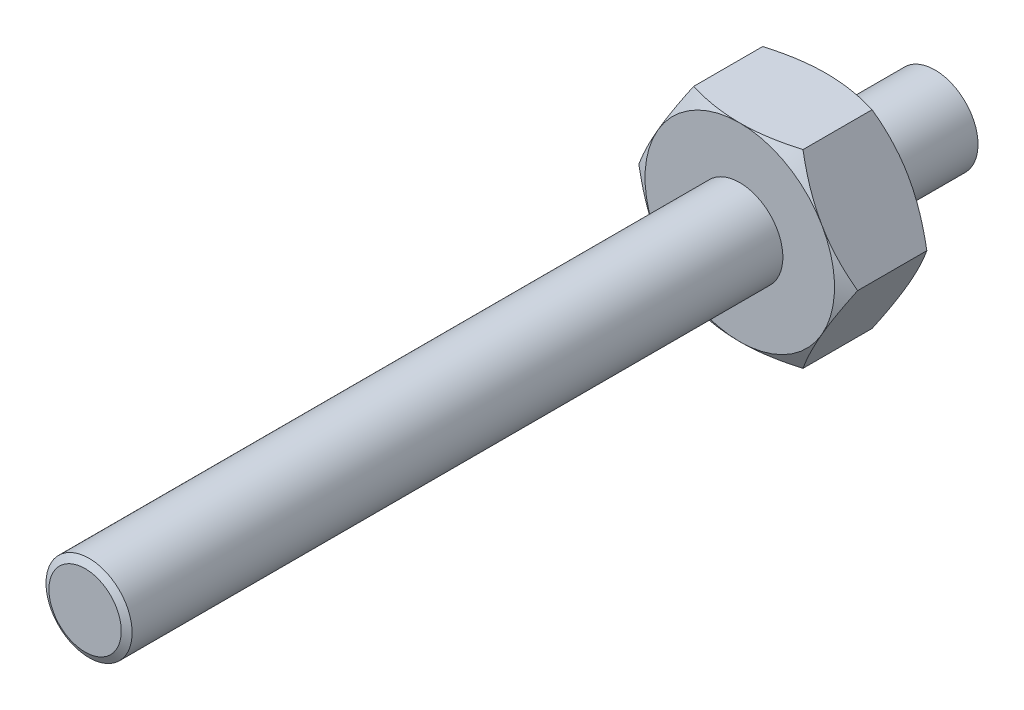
ISO-10303-21;
HEADER;
FILE_DESCRIPTION(('STEP AP214'),'2;1');
FILE_NAME('part.step','',(''),(''),'','','');
FILE_SCHEMA(('AUTOMOTIVE_DESIGN { 1 0 10303 214 1 1 1 1 }'));
ENDSEC;
DATA;
#1=APPLICATION_CONTEXT('core data for automotive mechanical design processes');
#2=APPLICATION_PROTOCOL_DEFINITION('international standard','automotive_design',2000,#1);
#3=PRODUCT_CONTEXT('',#1,'mechanical');
#4=PRODUCT('Part','Part','',(#3));
#5=PRODUCT_RELATED_PRODUCT_CATEGORY('part','',(#4));
#6=PRODUCT_DEFINITION_FORMATION('','',#4);
#7=PRODUCT_DEFINITION_CONTEXT('part definition',#1,'design');
#8=PRODUCT_DEFINITION('design','',#6,#7);
#9=PRODUCT_DEFINITION_SHAPE('','',#8);
#10=(LENGTH_UNIT() NAMED_UNIT(*) SI_UNIT(.MILLI.,.METRE.));
#11=(NAMED_UNIT(*) PLANE_ANGLE_UNIT() SI_UNIT($,.RADIAN.));
#12=(NAMED_UNIT(*) SI_UNIT($,.STERADIAN.) SOLID_ANGLE_UNIT());
#13=UNCERTAINTY_MEASURE_WITH_UNIT(LENGTH_MEASURE(1.E-05),#10,'distance_accuracy_value','');
#14=(GEOMETRIC_REPRESENTATION_CONTEXT(3) GLOBAL_UNCERTAINTY_ASSIGNED_CONTEXT((#13)) GLOBAL_UNIT_ASSIGNED_CONTEXT((#10,
#11,#12)) REPRESENTATION_CONTEXT('',''));
#15=CARTESIAN_POINT('',(0.,0.,0.));
#16=DIRECTION('',(0.,0.,1.));
#17=DIRECTION('',(1.,0.,0.));
#18=AXIS2_PLACEMENT_3D('',#15,#16,#17);
#19=CARTESIAN_POINT('',(0.,0.,0.));
#20=DIRECTION('',(0.,0.,-1.));
#21=DIRECTION('',(-1.,0.,0.));
#22=AXIS2_PLACEMENT_3D('',#19,#20,#21);
#23=CYLINDRICAL_SURFACE('',#22,5.);
#24=CARTESIAN_POINT('',(0.,0.,1.33962096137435));
#25=DIRECTION('',(0.,0.,1.));
#26=DIRECTION('',(1.,0.,0.));
#27=AXIS2_PLACEMENT_3D('',#24,#25,#26);
#28=CIRCLE('',#27,5.);
#29=CARTESIAN_POINT('',(0.,4.99999999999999,1.33962096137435));
#30=VERTEX_POINT('',#29);
#31=EDGE_CURVE('E251',#30,#30,#28,.T.);
#32=ORIENTED_EDGE('',*,*,#31,.T.);
#33=EDGE_LOOP('',(#32));
#34=FACE_BOUND('',#33,.T.);
#35=CARTESIAN_POINT('',(0.,0.,14.));
#36=DIRECTION('',(0.,0.,-1.));
#37=DIRECTION('',(-1.,0.,0.));
#38=AXIS2_PLACEMENT_3D('',#35,#36,#37);
#39=CIRCLE('',#38,5.);
#40=CARTESIAN_POINT('',(-5.,0.,14.));
#41=VERTEX_POINT('',#40);
#42=EDGE_CURVE('E252',#41,#41,#39,.T.);
#43=ORIENTED_EDGE('',*,*,#42,.T.);
#44=EDGE_LOOP('',(#43));
#45=FACE_BOUND('',#44,.T.);
#46=ADVANCED_FACE('F31',(#34,#45),#23,.T.);
#47=CARTESIAN_POINT('',(0.,13.5,14.));
#48=DIRECTION('',(0.,0.,1.));
#49=DIRECTION('',(1.,0.,0.));
#50=AXIS2_PLACEMENT_3D('',#47,#48,#49);
#51=PLANE('',#50);
#52=ORIENTED_EDGE('',*,*,#42,.F.);
#53=EDGE_LOOP('',(#52));
#54=FACE_BOUND('',#53,.T.);
#55=CARTESIAN_POINT('',(0.,0.,14.));
#56=DIRECTION('',(0.,0.,-1.));
#57=DIRECTION('',(-1.,0.,0.));
#58=AXIS2_PLACEMENT_3D('',#55,#56,#57);
#59=CIRCLE('',#58,11.);
#60=CARTESIAN_POINT('',(9.52627944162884,5.49999999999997,14.));
#61=VERTEX_POINT('',#60);
#62=CARTESIAN_POINT('',(9.52627944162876,-5.50000000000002,14.));
#63=VERTEX_POINT('',#62);
#64=EDGE_CURVE('E506',#61,#63,#59,.T.);
#65=ORIENTED_EDGE('',*,*,#64,.T.);
#66=CARTESIAN_POINT('',(0.,-11.,14.));
#67=VERTEX_POINT('',#66);
#68=EDGE_CURVE('E504',#63,#67,#59,.T.);
#69=ORIENTED_EDGE('',*,*,#68,.T.);
#70=CARTESIAN_POINT('',(-9.52627944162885,-5.49999999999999,14.));
#71=VERTEX_POINT('',#70);
#72=EDGE_CURVE('E500',#67,#71,#59,.T.);
#73=ORIENTED_EDGE('',*,*,#72,.T.);
#74=CARTESIAN_POINT('',(-9.52627944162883,5.5,14.));
#75=VERTEX_POINT('',#74);
#76=EDGE_CURVE('E51',#71,#75,#59,.T.);
#77=ORIENTED_EDGE('',*,*,#76,.T.);
#78=CARTESIAN_POINT('',(0.,11.,14.));
#79=VERTEX_POINT('',#78);
#80=EDGE_CURVE('E157',#75,#79,#59,.T.);
#81=ORIENTED_EDGE('',*,*,#80,.T.);
#82=EDGE_CURVE('E507',#79,#61,#59,.T.);
#83=ORIENTED_EDGE('',*,*,#82,.T.);
#84=EDGE_LOOP('',(#65,#69,#73,#77,#81,#83));
#85=FACE_BOUND('',#84,.T.);
#86=ADVANCED_FACE('F297',(#54,#85),#51,.F.);
#87=CARTESIAN_POINT('',(0.,0.,9.99987499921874));
#88=DIRECTION('',(0.,0.,-1.));
#89=DIRECTION('',(0.,1.,0.));
#90=AXIS2_PLACEMENT_3D('',#87,#88,#89);
#91=SPHERICAL_SURFACE('',#90,10.);
#92=CARTESIAN_POINT('',(0.,0.,0.));
#93=DIRECTION('',(0.,0.,-1.));
#94=DIRECTION('',(-1.,0.,0.));
#95=AXIS2_PLACEMENT_3D('',#92,#93,#94);
#96=CIRCLE('',#95,0.05);
#97=CARTESIAN_POINT('',(0.,0.050000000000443,0.));
#98=VERTEX_POINT('',#97);
#99=EDGE_CURVE('E248',#98,#98,#96,.T.);
#100=CARTESIAN_POINT('',(0.,0.050000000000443,0.));
#101=CARTESIAN_POINT('',(0.,0.104020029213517,0.000270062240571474));
#102=CARTESIAN_POINT('',(0.,0.158037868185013,0.000977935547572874));
#103=CARTESIAN_POINT('',(0.,0.266054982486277,0.00326893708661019));
#104=CARTESIAN_POINT('',(0.,0.320054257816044,0.00485206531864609));
#105=CARTESIAN_POINT('',(0.,0.428020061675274,0.00889320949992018));
#106=CARTESIAN_POINT('',(0.,0.481986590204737,0.0113512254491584));
#107=CARTESIAN_POINT('',(0.,0.589872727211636,0.0171414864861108));
#108=CARTESIAN_POINT('',(0.,0.643792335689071,0.0204737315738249));
#109=CARTESIAN_POINT('',(0.,0.751570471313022,0.0280115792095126));
#110=CARTESIAN_POINT('',(0.,0.805428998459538,0.032217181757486));
#111=CARTESIAN_POINT('',(0.,0.913070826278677,0.0415006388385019));
#112=CARTESIAN_POINT('',(0.,0.9668541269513,0.0465784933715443));
#113=CARTESIAN_POINT('',(0.,1.07433137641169,0.0576051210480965));
#114=CARTESIAN_POINT('',(0.,1.12802532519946,0.0635538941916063));
#115=CARTESIAN_POINT('',(0.,1.23530976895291,0.0763207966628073));
#116=CARTESIAN_POINT('',(0.,1.28890026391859,0.0831389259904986));
#117=CARTESIAN_POINT('',(0.,1.39596372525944,0.0976427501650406));
#118=CARTESIAN_POINT('',(0.,1.44943669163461,0.105328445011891));
#119=CARTESIAN_POINT('',(0.,1.55625105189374,0.121565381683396));
#120=CARTESIAN_POINT('',(0.,1.60959244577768,0.13011662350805));
#121=CARTESIAN_POINT('',(0.,1.71612965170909,0.148082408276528));
#122=CARTESIAN_POINT('',(0.,1.76932546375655,0.157496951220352));
#123=CARTESIAN_POINT('',(0.,1.87555753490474,0.177186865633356));
#124=CARTESIAN_POINT('',(0.,1.92859379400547,0.187462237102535));
#125=CARTESIAN_POINT('',(0.,2.03449283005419,0.208871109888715));
#126=CARTESIAN_POINT('',(0.,2.08735560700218,0.220004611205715));
#127=CARTESIAN_POINT('',(0.,2.19289379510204,0.243126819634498));
#128=CARTESIAN_POINT('',(0.,2.24556920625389,0.25511552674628));
#129=CARTESIAN_POINT('',(0.,2.35071882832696,0.279944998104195));
#130=CARTESIAN_POINT('',(0.,2.40319303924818,0.292785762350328));
#131=CARTESIAN_POINT('',(0.,2.50792647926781,0.319315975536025));
#132=CARTESIAN_POINT('',(0.,2.56018570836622,0.333005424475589));
#133=CARTESIAN_POINT('',(0.,2.66447545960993,0.361229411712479));
#134=CARTESIAN_POINT('',(0.,2.71650598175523,0.375763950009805));
#135=CARTESIAN_POINT('',(0.,2.820324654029,0.405674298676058));
#136=CARTESIAN_POINT('',(0.,2.87211280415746,0.421050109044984));
#137=CARTESIAN_POINT('',(0.,2.97543313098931,0.452638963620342));
#138=CARTESIAN_POINT('',(0.,3.0269653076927,0.468852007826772));
#139=CARTESIAN_POINT('',(0.,3.1297601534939,0.502111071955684));
#140=CARTESIAN_POINT('',(0.,3.18102282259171,0.519157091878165));
#141=CARTESIAN_POINT('',(0.,3.2832651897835,0.554077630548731));
#142=CARTESIAN_POINT('',(0.,3.33424488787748,0.571952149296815));
#143=CARTESIAN_POINT('',(0.,3.43590792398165,0.608524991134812));
#144=CARTESIAN_POINT('',(0.,3.48659126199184,0.627223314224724));
#145=CARTESIAN_POINT('',(0.,3.58764826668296,0.665438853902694));
#146=CARTESIAN_POINT('',(0.,3.63802193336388,0.684956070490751));
#147=CARTESIAN_POINT('',(0.,3.73844636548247,0.724804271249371));
#148=CARTESIAN_POINT('',(0.,3.78849713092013,0.745135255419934));
#149=CARTESIAN_POINT('',(0.,3.88826261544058,0.786605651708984));
#150=CARTESIAN_POINT('',(0.,3.93797733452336,0.807745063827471));
#151=CARTESIAN_POINT('',(0.,4.03705766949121,0.850826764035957));
#152=CARTESIAN_POINT('',(0.,4.08642328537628,0.872769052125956));
#153=CARTESIAN_POINT('',(0.,4.18479244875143,0.917450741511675));
#154=CARTESIAN_POINT('',(0.,4.23379599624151,0.940190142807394));
#155=CARTESIAN_POINT('',(0.,4.33142815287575,0.986460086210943));
#156=CARTESIAN_POINT('',(0.,4.38005676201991,1.00999062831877));
#157=CARTESIAN_POINT('',(0.,4.47692626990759,1.05783667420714));
#158=CARTESIAN_POINT('',(0.,4.52516716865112,1.08215217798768));
#159=CARTESIAN_POINT('',(0.,4.62124858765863,1.13156175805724));
#160=CARTESIAN_POINT('',(0.,4.66908910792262,1.15665583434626));
#161=CARTESIAN_POINT('',(0.,4.76435719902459,1.20761598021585));
#162=CARTESIAN_POINT('',(0.,4.81178476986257,1.23348204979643));
#163=CARTESIAN_POINT('',(0.,4.90621452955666,1.28597934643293));
#164=CARTESIAN_POINT('',(0.,4.95321671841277,1.31261057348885));
#165=CARTESIAN_POINT('',(0.,4.99999999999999,1.33962096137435));
#166=B_SPLINE_CURVE_WITH_KNOTS('',3,(#100,#101,#102,#103,#104,#105,#106,#107,#108,#109,#110,
#111,#112,#113,#114,#115,#116,#117,#118,#119,#120,#121,#122,#123,#124,#125,#126,#127,#128,#129,
#130,#131,#132,#133,#134,#135,#136,#137,#138,#139,#140,#141,#142,#143,#144,#145,#146,#147,#148,
#149,#150,#151,#152,#153,#154,#155,#156,#157,#158,#159,#160,#161,#162,#163,#164,#165),
.UNSPECIFIED.,.F.,.F.,(4,2,2,2,2,2,2,2,2,2,2,2,2,2,2,2,2,2,2,2,2,2,2,2,2,2,2,2,2,2,2,2,4),(0.,
0.16206033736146,0.324120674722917,0.486181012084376,0.648241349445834,0.810301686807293,
0.972362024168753,1.13442236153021,1.29648269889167,1.45854303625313,1.62060337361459,
1.78266371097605,1.94472404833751,2.10678438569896,2.26884472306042,2.43090506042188,
2.59296539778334,2.7550257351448,2.91708607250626,3.07914640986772,3.24120674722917,
3.40326708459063,3.56532742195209,3.72738775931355,3.88944809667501,4.05150843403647,
4.21356877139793,4.37562910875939,4.53768944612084,4.6997497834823,4.86181012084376,
5.02387045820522,5.18593079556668),.UNSPECIFIED.);
#167=EDGE_CURVE('BSEAM187',#98,#30,#166,.T.);
#168=ORIENTED_EDGE('',*,*,#99,.F.);
#169=ORIENTED_EDGE('',*,*,#31,.F.);
#170=ORIENTED_EDGE('',*,*,#167,.T.);
#171=ORIENTED_EDGE('',*,*,#167,.F.);
#172=EDGE_LOOP('',(#168,#170,#169,#171));
#173=FACE_BOUND('',#172,.T.);
#174=ADVANCED_FACE('F187',(#173),#91,.T.);
#175=CARTESIAN_POINT('',(-1.12757025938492E-13,-21.9999999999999,0.));
#176=DIRECTION('',(0.,0.,-1.));
#177=DIRECTION('',(-1.,0.,0.));
#178=AXIS2_PLACEMENT_3D('',#175,#176,#177);
#179=PLANE('',#178);
#180=ORIENTED_EDGE('',*,*,#99,.T.);
#181=EDGE_LOOP('',(#180));
#182=FACE_BOUND('',#181,.T.);
#183=ADVANCED_FACE('F343',(#182),#179,.T.);
#184=CARTESIAN_POINT('',(0.,0.,15.0675202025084));
#185=DIRECTION('',(0.,0.,1.));
#186=DIRECTION('',(1.,0.,0.));
#187=AXIS2_PLACEMENT_3D('',#184,#185,#186);
#188=CONICAL_SURFACE('',#187,12.8489992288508,1.0471975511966);
#189=CARTESIAN_POINT('',(-6.35073749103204,11.0002,14.9825470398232));
#190=CARTESIAN_POINT('',(-6.49034297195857,10.7583962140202,14.9019591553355));
#191=CARTESIAN_POINT('',(-6.63046897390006,10.515690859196,14.8250289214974));
#192=CARTESIAN_POINT('',(-6.91184468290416,10.0283338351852,14.6794986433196));
#193=CARTESIAN_POINT('',(-7.05309474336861,9.78368155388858,14.6109013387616));
#194=CARTESIAN_POINT('',(-7.47912088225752,9.0457826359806,14.4189363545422));
#195=CARTESIAN_POINT('',(-7.7655787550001,8.54962304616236,14.3097477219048));
#196=CARTESIAN_POINT('',(-8.19424982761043,7.80714296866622,14.1817141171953));
#197=CARTESIAN_POINT('',(-8.33518236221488,7.56304065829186,14.1452422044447));
#198=CARTESIAN_POINT('',(-8.61769996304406,7.07370581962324,14.084081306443));
#199=CARTESIAN_POINT('',(-8.7592850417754,6.82847326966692,14.0593925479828));
#200=CARTESIAN_POINT('',(-9.0426912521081,6.33759931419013,14.0224303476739));
#201=CARTESIAN_POINT('',(-9.18451190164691,6.0919587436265,14.0101421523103));
#202=CARTESIAN_POINT('',(-9.468284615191,5.60044998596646,13.9982429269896));
#203=CARTESIAN_POINT('',(-9.61023667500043,5.35458180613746,13.9986315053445));
#204=CARTESIAN_POINT('',(-9.8756168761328,4.89492981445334,14.0112011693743));
#205=CARTESIAN_POINT('',(-9.99906394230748,4.68111322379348,14.0218490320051));
#206=CARTESIAN_POINT('',(-10.2456741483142,4.25397181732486,14.0525316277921));
#207=CARTESIAN_POINT('',(-10.3688372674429,4.04064703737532,14.0725670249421));
#208=CARTESIAN_POINT('',(-10.6148126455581,3.61460518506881,14.1216753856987));
#209=CARTESIAN_POINT('',(-10.7376245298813,3.40188876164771,14.150755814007));
#210=CARTESIAN_POINT('',(-10.9826725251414,2.97745318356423,14.2174439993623));
#211=CARTESIAN_POINT('',(-11.1049085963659,2.76573409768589,14.2550523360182));
#212=CARTESIAN_POINT('',(-11.4759630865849,2.12304886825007,14.3816199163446));
#213=CARTESIAN_POINT('',(-11.7237069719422,1.69394387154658,14.4831994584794));
#214=CARTESIAN_POINT('',(-12.2155005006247,0.842132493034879,14.7137436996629));
#215=CARTESIAN_POINT('',(-12.4595564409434,0.419415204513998,14.8426542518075));
#216=CARTESIAN_POINT('',(-12.7018213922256,-0.000200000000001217,14.9825470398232));
#217=B_SPLINE_CURVE_WITH_KNOTS('',3,(#189,#190,#191,#192,#193,#194,#195,#196,#197,#198,#199,
#200,#201,#202,#203,#204,#205,#206,#207,#208,#209,#210,#211,#212,#213,#214,#215,#216),
.UNSPECIFIED.,.F.,.F.,(4,2,2,2,2,2,2,2,2,2,2,2,2,4),(0.,0.871755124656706,1.74379610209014,
3.49159027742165,4.34403665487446,5.19649943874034,6.04794680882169,6.89936787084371,
7.64056020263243,8.38180496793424,9.12366309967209,9.86557166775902,11.3820155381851,
12.8954827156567),.UNSPECIFIED.);
#218=CARTESIAN_POINT('',(-12.7017059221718,0.,14.9824803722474));
#219=VERTEX_POINT('',#218);
#220=EDGE_CURVE('E35',#75,#219,#217,.T.);
#221=ORIENTED_EDGE('',*,*,#220,.F.);
#222=ORIENTED_EDGE('',*,*,#76,.F.);
#223=CARTESIAN_POINT('',(-12.7018213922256,0.000199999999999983,14.9825470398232));
#224=CARTESIAN_POINT('',(-12.5622159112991,-0.241603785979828,14.9019591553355));
#225=CARTESIAN_POINT('',(-12.4220899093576,-0.484309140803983,14.8250289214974));
#226=CARTESIAN_POINT('',(-12.1407142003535,-0.971666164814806,14.6794986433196));
#227=CARTESIAN_POINT('',(-11.999464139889,-1.21631844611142,14.6109013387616));
#228=CARTESIAN_POINT('',(-11.5734380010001,-1.9542173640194,14.4189363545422));
#229=CARTESIAN_POINT('',(-11.2869801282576,-2.45037695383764,14.3097477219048));
#230=CARTESIAN_POINT('',(-10.8583090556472,-3.19285703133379,14.1817141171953));
#231=CARTESIAN_POINT('',(-10.7173765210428,-3.43695934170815,14.1452422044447));
#232=CARTESIAN_POINT('',(-10.4348589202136,-3.92629418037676,14.084081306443));
#233=CARTESIAN_POINT('',(-10.2932738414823,-4.17152673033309,14.0593925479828));
#234=CARTESIAN_POINT('',(-10.0098676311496,-4.66240068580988,14.0224303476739));
#235=CARTESIAN_POINT('',(-9.86804698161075,-4.90804125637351,14.0101421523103));
#236=CARTESIAN_POINT('',(-9.58427426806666,-5.39955001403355,13.9982429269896));
#237=CARTESIAN_POINT('',(-9.44232220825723,-5.64541819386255,13.9986315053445));
#238=CARTESIAN_POINT('',(-9.17694200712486,-6.10507018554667,14.0112011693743));
#239=CARTESIAN_POINT('',(-9.05349494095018,-6.31888677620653,14.0218490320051));
#240=CARTESIAN_POINT('',(-8.80688473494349,-6.74602818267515,14.0525316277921));
#241=CARTESIAN_POINT('',(-8.6837216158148,-6.95935296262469,14.0725670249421));
#242=CARTESIAN_POINT('',(-8.43774623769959,-7.3853948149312,14.1216753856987));
#243=CARTESIAN_POINT('',(-8.31493435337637,-7.5981112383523,14.150755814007));
#244=CARTESIAN_POINT('',(-8.06988635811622,-8.02254681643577,14.2174439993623));
#245=CARTESIAN_POINT('',(-7.94765028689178,-8.23426590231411,14.2550523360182));
#246=CARTESIAN_POINT('',(-7.57659579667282,-8.87695113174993,14.3816199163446));
#247=CARTESIAN_POINT('',(-7.32885191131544,-9.30605612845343,14.4831994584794));
#248=CARTESIAN_POINT('',(-6.83705838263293,-10.1578675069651,14.7137436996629));
#249=CARTESIAN_POINT('',(-6.5930024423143,-10.580584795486,14.8426542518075));
#250=CARTESIAN_POINT('',(-6.35073749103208,-11.0002,14.9825470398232));
#251=B_SPLINE_CURVE_WITH_KNOTS('',3,(#223,#224,#225,#226,#227,#228,#229,#230,#231,#232,#233,
#234,#235,#236,#237,#238,#239,#240,#241,#242,#243,#244,#245,#246,#247,#248,#249,#250),
.UNSPECIFIED.,.F.,.F.,(4,2,2,2,2,2,2,2,2,2,2,2,2,4),(0.,0.871755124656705,1.74379610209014,
3.49159027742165,4.34403665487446,5.19649943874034,6.04794680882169,6.89936787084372,
7.64056020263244,8.38180496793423,9.12366309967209,9.86557166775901,11.3820155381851,
12.8954827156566),.UNSPECIFIED.);
#252=EDGE_CURVE('E247',#219,#71,#251,.T.);
#253=ORIENTED_EDGE('',*,*,#252,.F.);
#254=EDGE_LOOP('',(#221,#222,#253));
#255=FACE_BOUND('',#254,.T.);
#256=ADVANCED_FACE('F185',(#255),#188,.T.);
#257=ORIENTED_EDGE('',*,*,#80,.F.);
#258=CARTESIAN_POINT('',(-6.35085296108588,11.,14.9824803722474));
#259=VERTEX_POINT('',#258);
#260=EDGE_CURVE('E11',#259,#75,#217,.T.);
#261=ORIENTED_EDGE('',*,*,#260,.F.);
#262=CARTESIAN_POINT('',(-16.8551959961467,11.,19.2694974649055));
#263=CARTESIAN_POINT('',(-16.6136778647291,11.,19.152726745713));
#264=CARTESIAN_POINT('',(-16.3718681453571,11.,19.0365594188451));
#265=CARTESIAN_POINT('',(-15.8876039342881,11.,18.8055700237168));
#266=CARTESIAN_POINT('',(-15.6451494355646,11.,18.6907479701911));
#267=CARTESIAN_POINT('',(-14.9166555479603,11.,18.3484742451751));
#268=CARTESIAN_POINT('',(-14.4295640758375,11.,18.1232529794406));
#269=CARTESIAN_POINT('',(-13.4492378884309,11.,17.6789236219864));
#270=CARTESIAN_POINT('',(-12.9559839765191,11.,17.4598577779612));
#271=CARTESIAN_POINT('',(-11.9654269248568,11.,17.0311147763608));
#272=CARTESIAN_POINT('',(-11.468123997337,11.,16.8214371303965));
#273=CARTESIAN_POINT('',(-10.4624497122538,11.,16.4114607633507));
#274=CARTESIAN_POINT('',(-9.954017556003,11.,16.2113104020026));
#275=CARTESIAN_POINT('',(-8.93115689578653,11.,15.826655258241));
#276=CARTESIAN_POINT('',(-8.41672773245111,11.,15.6421522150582));
#277=CARTESIAN_POINT('',(-7.38212420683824,11.,15.2937431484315));
#278=CARTESIAN_POINT('',(-6.86196467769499,11.,15.1297934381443));
#279=CARTESIAN_POINT('',(-5.81420027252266,11.,14.8277998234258));
#280=CARTESIAN_POINT('',(-5.28659780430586,11.,14.6897477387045));
#281=CARTESIAN_POINT('',(-4.48951244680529,11.,14.5071413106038));
#282=CARTESIAN_POINT('',(-4.22281644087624,11.,14.4503422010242));
#283=CARTESIAN_POINT('',(-3.68764685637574,11.,14.3457965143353));
#284=CARTESIAN_POINT('',(-3.41917331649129,11.,14.2980497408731));
#285=CARTESIAN_POINT('',(-2.88062269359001,11.,14.2124537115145));
#286=CARTESIAN_POINT('',(-2.6105454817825,11.,14.1746052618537));
#287=CARTESIAN_POINT('',(-2.06911263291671,11.,14.1095683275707));
#288=CARTESIAN_POINT('',(-1.79775704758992,11.,14.0823794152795));
#289=CARTESIAN_POINT('',(-1.2558762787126,11.,14.039391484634));
#290=CARTESIAN_POINT('',(-0.985356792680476,11.,14.0235211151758));
#291=CARTESIAN_POINT('',(-0.443889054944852,11.,14.0032547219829));
#292=CARTESIAN_POINT('',(-0.172940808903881,11.,13.9988585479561));
#293=CARTESIAN_POINT('',(0.36882082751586,11.,14.0016449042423));
#294=CARTESIAN_POINT('',(0.639634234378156,11.,14.0088241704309));
#295=CARTESIAN_POINT('',(1.18072209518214,11.,14.034582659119));
#296=CARTESIAN_POINT('',(1.45099652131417,11.,14.053162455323));
#297=CARTESIAN_POINT('',(2.10568001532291,11.,14.1115880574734));
#298=CARTESIAN_POINT('',(2.48958955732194,11.,14.1571247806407));
#299=CARTESIAN_POINT('',(3.25447472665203,11.,14.2686757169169));
#300=CARTESIAN_POINT('',(3.63544952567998,11.,14.3346955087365));
#301=CARTESIAN_POINT('',(4.39414827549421,11.,14.4848711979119));
#302=CARTESIAN_POINT('',(4.77186880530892,11.,14.5690442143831));
#303=CARTESIAN_POINT('',(5.52342739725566,11.,14.7529574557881));
#304=CARTESIAN_POINT('',(5.89726582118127,11.,14.8526962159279));
#305=CARTESIAN_POINT('',(6.65028401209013,11.,15.0679659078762));
#306=CARTESIAN_POINT('',(7.02936944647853,11.,15.183824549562));
#307=CARTESIAN_POINT('',(7.78353362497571,11.,15.4270144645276));
#308=CARTESIAN_POINT('',(8.15861493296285,11.,15.5543378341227));
#309=CARTESIAN_POINT('',(8.90326602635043,11.,15.8178251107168));
#310=CARTESIAN_POINT('',(9.27285494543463,11.,15.9539352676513));
#311=CARTESIAN_POINT('',(10.0091631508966,11.,16.2341606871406));
#312=CARTESIAN_POINT('',(10.3758812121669,11.,16.3782791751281));
#313=CARTESIAN_POINT('',(10.7412659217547,11.,16.5256101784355));
#314=B_SPLINE_CURVE_WITH_KNOTS('',3,(#262,#263,#264,#265,#266,#267,#268,#269,#270,#271,#272,
#273,#274,#275,#276,#277,#278,#279,#280,#281,#282,#283,#284,#285,#286,#287,#288,#289,#290,#291,
#292,#293,#294,#295,#296,#297,#298,#299,#300,#301,#302,#303,#304,#305,#306,#307,#308,#309,#310,
#311,#312,#313),.UNSPECIFIED.,.F.,.F.,(4,2,2,2,2,2,2,2,2,2,2,2,2,2,2,2,2,2,2,2,2,2,2,2,2,4),(0.,
0.804795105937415,1.60959901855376,3.21946791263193,4.83852884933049,6.45750546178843,
8.09653750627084,9.73575149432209,11.3714199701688,13.0065709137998,13.8244738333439,
14.642359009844,15.4603107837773,16.2782297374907,17.0909459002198,17.9036514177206,
18.7161278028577,19.5286450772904,20.6878016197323,21.8472741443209,23.007844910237,
24.1683065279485,25.3572707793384,26.5454215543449,27.7268897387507,28.9088372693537),.UNSPECIFIED.);
#315=EDGE_CURVE('E520',#79,#259,#314,.F.);
#316=ORIENTED_EDGE('',*,*,#315,.F.);
#317=EDGE_LOOP('',(#257,#261,#316));
#318=FACE_BOUND('',#317,.T.);
#319=ADVANCED_FACE('F342',(#318),#188,.T.);
#320=ORIENTED_EDGE('',*,*,#82,.F.);
#321=CARTESIAN_POINT('',(6.3508529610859,11.,14.9824803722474));
#322=VERTEX_POINT('',#321);
#323=EDGE_CURVE('E516',#322,#79,#314,.F.);
#324=ORIENTED_EDGE('',*,*,#323,.F.);
#325=CARTESIAN_POINT('',(12.7018213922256,-0.0002,14.9825470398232));
#326=CARTESIAN_POINT('',(12.5622159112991,0.241603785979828,14.9019591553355));
#327=CARTESIAN_POINT('',(12.4220899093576,0.484309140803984,14.8250289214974));
#328=CARTESIAN_POINT('',(12.1407142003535,0.971666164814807,14.6794986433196));
#329=CARTESIAN_POINT('',(11.999464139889,1.21631844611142,14.6109013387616));
#330=CARTESIAN_POINT('',(11.5734380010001,1.9542173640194,14.4189363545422));
#331=CARTESIAN_POINT('',(11.2869801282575,2.45037695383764,14.3097477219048));
#332=CARTESIAN_POINT('',(10.8583090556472,3.19285703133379,14.1817141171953));
#333=CARTESIAN_POINT('',(10.7173765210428,3.43695934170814,14.1452422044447));
#334=CARTESIAN_POINT('',(10.4348589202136,3.92629418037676,14.084081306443));
#335=CARTESIAN_POINT('',(10.2932738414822,4.17152673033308,14.0593925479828));
#336=CARTESIAN_POINT('',(10.0098676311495,4.66240068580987,14.0224303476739));
#337=CARTESIAN_POINT('',(9.86804698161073,4.9080412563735,14.0101421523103));
#338=CARTESIAN_POINT('',(9.58427426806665,5.39955001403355,13.9982429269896));
#339=CARTESIAN_POINT('',(9.44232220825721,5.64541819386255,13.9986315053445));
#340=CARTESIAN_POINT('',(9.17694200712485,6.10507018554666,14.0112011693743));
#341=CARTESIAN_POINT('',(9.05349494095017,6.31888677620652,14.0218490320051));
#342=CARTESIAN_POINT('',(8.80688473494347,6.74602818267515,14.0525316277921));
#343=CARTESIAN_POINT('',(8.68372161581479,6.95935296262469,14.0725670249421));
#344=CARTESIAN_POINT('',(8.43774623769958,7.3853948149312,14.1216753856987));
#345=CARTESIAN_POINT('',(8.31493435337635,7.5981112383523,14.150755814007));
#346=CARTESIAN_POINT('',(8.06988635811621,8.02254681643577,14.2174439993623));
#347=CARTESIAN_POINT('',(7.94765028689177,8.23426590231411,14.2550523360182));
#348=CARTESIAN_POINT('',(7.5765957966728,8.87695113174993,14.3816199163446));
#349=CARTESIAN_POINT('',(7.32885191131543,9.30605612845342,14.4831994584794));
#350=CARTESIAN_POINT('',(6.83705838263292,10.1578675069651,14.7137436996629));
#351=CARTESIAN_POINT('',(6.59300244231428,10.580584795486,14.8426542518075));
#352=CARTESIAN_POINT('',(6.35073749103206,11.0002,14.9825470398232));
#353=B_SPLINE_CURVE_WITH_KNOTS('',3,(#325,#326,#327,#328,#329,#330,#331,#332,#333,#334,#335,
#336,#337,#338,#339,#340,#341,#342,#343,#344,#345,#346,#347,#348,#349,#350,#351,#352),
.UNSPECIFIED.,.F.,.F.,(4,2,2,2,2,2,2,2,2,2,2,2,2,4),(0.,0.871755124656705,1.74379610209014,
3.49159027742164,4.34403665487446,5.19649943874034,6.04794680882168,6.89936787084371,
7.64056020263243,8.38180496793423,9.12366309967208,9.865571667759,11.3820155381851,
12.8954827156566),.UNSPECIFIED.);
#354=EDGE_CURVE('E513',#61,#322,#353,.T.);
#355=ORIENTED_EDGE('',*,*,#354,.F.);
#356=EDGE_LOOP('',(#320,#324,#355));
#357=FACE_BOUND('',#356,.T.);
#358=ADVANCED_FACE('F353',(#357),#188,.T.);
#359=ORIENTED_EDGE('',*,*,#64,.F.);
#360=CARTESIAN_POINT('',(12.7017059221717,0.,14.9824803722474));
#361=VERTEX_POINT('',#360);
#362=EDGE_CURVE('E511',#361,#61,#353,.T.);
#363=ORIENTED_EDGE('',*,*,#362,.F.);
#364=CARTESIAN_POINT('',(6.35073749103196,-11.0002,14.9825470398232));
#365=CARTESIAN_POINT('',(6.49034297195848,-10.7583962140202,14.9019591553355));
#366=CARTESIAN_POINT('',(6.63046897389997,-10.515690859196,14.8250289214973));
#367=CARTESIAN_POINT('',(6.91184468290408,-10.0283338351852,14.6794986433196));
#368=CARTESIAN_POINT('',(7.05309474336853,-9.78368155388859,14.6109013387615));
#369=CARTESIAN_POINT('',(7.47912088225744,-9.04578263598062,14.4189363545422));
#370=CARTESIAN_POINT('',(7.76557875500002,-8.54962304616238,14.3097477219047));
#371=CARTESIAN_POINT('',(8.19424982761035,-7.80714296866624,14.1817141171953));
#372=CARTESIAN_POINT('',(8.3351823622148,-7.56304065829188,14.1452422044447));
#373=CARTESIAN_POINT('',(8.61769996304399,-7.07370581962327,14.084081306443));
#374=CARTESIAN_POINT('',(8.75928504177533,-6.82847326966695,14.0593925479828));
#375=CARTESIAN_POINT('',(9.04269125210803,-6.33759931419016,14.0224303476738));
#376=CARTESIAN_POINT('',(9.18451190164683,-6.09195874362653,14.0101421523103));
#377=CARTESIAN_POINT('',(9.46828461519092,-5.60044998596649,13.9982429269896));
#378=CARTESIAN_POINT('',(9.61023667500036,-5.35458180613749,13.9986315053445));
#379=CARTESIAN_POINT('',(9.87561687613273,-4.89492981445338,14.0112011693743));
#380=CARTESIAN_POINT('',(9.99906394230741,-4.68111322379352,14.0218490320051));
#381=CARTESIAN_POINT('',(10.2456741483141,-4.25397181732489,14.0525316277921));
#382=CARTESIAN_POINT('',(10.3688372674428,-4.04064703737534,14.072567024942));
#383=CARTESIAN_POINT('',(10.614812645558,-3.61460518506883,14.1216753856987));
#384=CARTESIAN_POINT('',(10.7376245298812,-3.40188876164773,14.150755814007));
#385=CARTESIAN_POINT('',(10.9826725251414,-2.97745318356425,14.2174439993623));
#386=CARTESIAN_POINT('',(11.1049085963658,-2.76573409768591,14.2550523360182));
#387=CARTESIAN_POINT('',(11.4759630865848,-2.12304886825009,14.3816199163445));
#388=CARTESIAN_POINT('',(11.7237069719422,-1.69394387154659,14.4831994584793));
#389=CARTESIAN_POINT('',(12.2155005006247,-0.842132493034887,14.7137436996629));
#390=CARTESIAN_POINT('',(12.4595564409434,-0.419415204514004,14.8426542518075));
#391=CARTESIAN_POINT('',(12.7018213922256,0.000199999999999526,14.9825470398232));
#392=B_SPLINE_CURVE_WITH_KNOTS('',3,(#364,#365,#366,#367,#368,#369,#370,#371,#372,#373,#374,
#375,#376,#377,#378,#379,#380,#381,#382,#383,#384,#385,#386,#387,#388,#389,#390,#391),
.UNSPECIFIED.,.F.,.F.,(4,2,2,2,2,2,2,2,2,2,2,2,2,4),(0.,0.871755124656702,1.74379610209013,
3.49159027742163,4.34403665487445,5.19649943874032,6.04794680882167,6.89936787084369,
7.64056020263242,8.38180496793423,9.12366309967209,9.86557166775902,11.3820155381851,
12.8954827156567),.UNSPECIFIED.);
#393=EDGE_CURVE('E236',#63,#361,#392,.T.);
#394=ORIENTED_EDGE('',*,*,#393,.F.);
#395=EDGE_LOOP('',(#359,#363,#394));
#396=FACE_BOUND('',#395,.T.);
#397=ADVANCED_FACE('F362',(#396),#188,.T.);
#398=ORIENTED_EDGE('',*,*,#68,.F.);
#399=CARTESIAN_POINT('',(6.35085296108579,-11.,14.9824803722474));
#400=VERTEX_POINT('',#399);
#401=EDGE_CURVE('E59',#400,#63,#392,.T.);
#402=ORIENTED_EDGE('',*,*,#401,.F.);
#403=CARTESIAN_POINT('',(-16.8551959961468,-11.,19.2694974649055));
#404=CARTESIAN_POINT('',(-16.6136778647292,-11.,19.152726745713));
#405=CARTESIAN_POINT('',(-16.3718681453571,-11.,19.0365594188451));
#406=CARTESIAN_POINT('',(-15.8876039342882,-11.,18.8055700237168));
#407=CARTESIAN_POINT('',(-15.6451494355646,-11.,18.6907479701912));
#408=CARTESIAN_POINT('',(-14.9166555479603,-11.,18.3484742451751));
#409=CARTESIAN_POINT('',(-14.4295640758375,-11.,18.1232529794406));
#410=CARTESIAN_POINT('',(-13.4492378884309,-11.,17.6789236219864));
#411=CARTESIAN_POINT('',(-12.9559839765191,-11.,17.4598577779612));
#412=CARTESIAN_POINT('',(-11.9654269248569,-11.,17.0311147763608));
#413=CARTESIAN_POINT('',(-11.4681239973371,-11.,16.8214371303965));
#414=CARTESIAN_POINT('',(-10.4624497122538,-11.,16.4114607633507));
#415=CARTESIAN_POINT('',(-9.95401755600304,-11.,16.2113104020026));
#416=CARTESIAN_POINT('',(-8.93115689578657,-11.,15.826655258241));
#417=CARTESIAN_POINT('',(-8.41672773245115,-11.,15.6421522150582));
#418=CARTESIAN_POINT('',(-7.38212420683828,-11.,15.2937431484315));
#419=CARTESIAN_POINT('',(-6.86196467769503,-11.,15.1297934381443));
#420=CARTESIAN_POINT('',(-5.81420027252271,-11.,14.8277998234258));
#421=CARTESIAN_POINT('',(-5.2865978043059,-11.,14.6897477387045));
#422=CARTESIAN_POINT('',(-4.48951244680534,-11.,14.5071413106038));
#423=CARTESIAN_POINT('',(-4.22281644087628,-11.,14.4503422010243));
#424=CARTESIAN_POINT('',(-3.68764685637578,-11.,14.3457965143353));
#425=CARTESIAN_POINT('',(-3.41917331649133,-11.,14.2980497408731));
#426=CARTESIAN_POINT('',(-2.88062269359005,-11.,14.2124537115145));
#427=CARTESIAN_POINT('',(-2.61054548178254,-11.,14.1746052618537));
#428=CARTESIAN_POINT('',(-2.06911263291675,-11.,14.1095683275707));
#429=CARTESIAN_POINT('',(-1.79775704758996,-11.,14.0823794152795));
#430=CARTESIAN_POINT('',(-1.25587627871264,-11.,14.039391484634));
#431=CARTESIAN_POINT('',(-0.985356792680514,-11.,14.0235211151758));
#432=CARTESIAN_POINT('',(-0.443889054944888,-11.,14.0032547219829));
#433=CARTESIAN_POINT('',(-0.172940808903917,-11.,13.9988585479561));
#434=CARTESIAN_POINT('',(0.368820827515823,-11.,14.0016449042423));
#435=CARTESIAN_POINT('',(0.639634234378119,-11.,14.0088241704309));
#436=CARTESIAN_POINT('',(1.1807220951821,-11.,14.034582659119));
#437=CARTESIAN_POINT('',(1.45099652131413,-11.,14.053162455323));
#438=CARTESIAN_POINT('',(2.10568001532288,-11.,14.1115880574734));
#439=CARTESIAN_POINT('',(2.48958955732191,-11.,14.1571247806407));
#440=CARTESIAN_POINT('',(3.25447472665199,-11.,14.2686757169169));
#441=CARTESIAN_POINT('',(3.63544952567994,-11.,14.3346955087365));
#442=CARTESIAN_POINT('',(4.39414827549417,-11.,14.4848711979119));
#443=CARTESIAN_POINT('',(4.77186880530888,-11.,14.5690442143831));
#444=CARTESIAN_POINT('',(5.52342739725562,-11.,14.7529574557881));
#445=CARTESIAN_POINT('',(5.89726582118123,-11.,14.8526962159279));
#446=CARTESIAN_POINT('',(6.65028401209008,-11.,15.0679659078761));
#447=CARTESIAN_POINT('',(7.02936944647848,-11.,15.183824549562));
#448=CARTESIAN_POINT('',(7.78353362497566,-11.,15.4270144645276));
#449=CARTESIAN_POINT('',(8.1586149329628,-11.,15.5543378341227));
#450=CARTESIAN_POINT('',(8.90326602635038,-11.,15.8178251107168));
#451=CARTESIAN_POINT('',(9.27285494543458,-11.,15.9539352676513));
#452=CARTESIAN_POINT('',(10.0091631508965,-11.,16.2341606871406));
#453=CARTESIAN_POINT('',(10.3758812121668,-11.,16.3782791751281));
#454=CARTESIAN_POINT('',(10.7412659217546,-11.,16.5256101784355));
#455=B_SPLINE_CURVE_WITH_KNOTS('',3,(#403,#404,#405,#406,#407,#408,#409,#410,#411,#412,#413,
#414,#415,#416,#417,#418,#419,#420,#421,#422,#423,#424,#425,#426,#427,#428,#429,#430,#431,#432,
#433,#434,#435,#436,#437,#438,#439,#440,#441,#442,#443,#444,#445,#446,#447,#448,#449,#450,#451,
#452,#453,#454),.UNSPECIFIED.,.F.,.F.,(4,2,2,2,2,2,2,2,2,2,2,2,2,2,2,2,2,2,2,2,2,2,2,2,2,4),(0.,
0.804795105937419,1.60959901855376,3.21946791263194,4.8385288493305,6.45750546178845,
8.09653750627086,9.73575149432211,11.3714199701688,13.0065709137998,13.8244738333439,
14.642359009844,15.4603107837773,16.2782297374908,17.0909459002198,17.9036514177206,
18.7161278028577,19.5286450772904,20.6878016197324,21.8472741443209,23.007844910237,
24.1683065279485,25.3572707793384,26.5454215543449,27.7268897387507,28.9088372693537),.UNSPECIFIED.);
#456=EDGE_CURVE('E228',#67,#400,#455,.T.);
#457=ORIENTED_EDGE('',*,*,#456,.F.);
#458=EDGE_LOOP('',(#398,#402,#457));
#459=FACE_BOUND('',#458,.T.);
#460=ADVANCED_FACE('F371',(#459),#188,.T.);
#461=ORIENTED_EDGE('',*,*,#72,.F.);
#462=CARTESIAN_POINT('',(-6.35085296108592,-11.,14.9824803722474));
#463=VERTEX_POINT('',#462);
#464=EDGE_CURVE('E235',#463,#67,#455,.T.);
#465=ORIENTED_EDGE('',*,*,#464,.F.);
#466=EDGE_CURVE('E241',#71,#463,#251,.T.);
#467=ORIENTED_EDGE('',*,*,#466,.F.);
#468=EDGE_LOOP('',(#461,#465,#467));
#469=FACE_BOUND('',#468,.T.);
#470=ADVANCED_FACE('F344',(#469),#188,.T.);
#471=CARTESIAN_POINT('',(-6.35085296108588,11.,100.));
#472=DIRECTION('',(0.866025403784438,-0.5,0.));
#473=DIRECTION('',(0.5,0.866025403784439,0.));
#474=AXIS2_PLACEMENT_3D('',#471,#472,#473);
#475=PLANE('',#474);
#476=DIRECTION('',(0.,0.,-1.));
#477=VECTOR('',#476,1.);
#478=CARTESIAN_POINT('',(-12.7017059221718,0.,100.));
#479=LINE('',#478,#477);
#480=CARTESIAN_POINT('',(-12.7017059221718,0.,23.0175196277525));
#481=VERTEX_POINT('',#480);
#482=EDGE_CURVE('E163',#481,#219,#479,.T.);
#483=ORIENTED_EDGE('',*,*,#482,.F.);
#484=CARTESIAN_POINT('',(-12.7018213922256,-0.000199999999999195,23.0174529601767));
#485=CARTESIAN_POINT('',(-12.5622159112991,0.241603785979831,23.0980408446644));
#486=CARTESIAN_POINT('',(-12.4220899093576,0.484309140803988,23.1749710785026));
#487=CARTESIAN_POINT('',(-12.1407142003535,0.971666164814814,23.3205013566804));
#488=CARTESIAN_POINT('',(-11.999464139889,1.21631844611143,23.3890986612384));
#489=CARTESIAN_POINT('',(-11.5734380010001,1.95421736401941,23.5810636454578));
#490=CARTESIAN_POINT('',(-11.2869801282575,2.45037695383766,23.6902522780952));
#491=CARTESIAN_POINT('',(-10.8583090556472,3.19285703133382,23.8182858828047));
#492=CARTESIAN_POINT('',(-10.7173765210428,3.43695934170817,23.8547577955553));
#493=CARTESIAN_POINT('',(-10.4348589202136,3.92629418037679,23.915918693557));
#494=CARTESIAN_POINT('',(-10.2932738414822,4.17152673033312,23.9406074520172));
#495=CARTESIAN_POINT('',(-10.0098676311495,4.66240068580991,23.9775696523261));
#496=CARTESIAN_POINT('',(-9.86804698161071,4.90804125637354,23.9898578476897));
#497=CARTESIAN_POINT('',(-9.58427426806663,5.39955001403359,24.0017570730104));
#498=CARTESIAN_POINT('',(-9.44232220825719,5.6454181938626,24.0013684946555));
#499=CARTESIAN_POINT('',(-9.17694200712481,6.10507018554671,23.9887988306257));
#500=CARTESIAN_POINT('',(-9.05349494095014,6.31888677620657,23.9781509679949));
#501=CARTESIAN_POINT('',(-8.80688473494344,6.74602818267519,23.9474683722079));
#502=CARTESIAN_POINT('',(-8.68372161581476,6.95935296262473,23.9274329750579));
#503=CARTESIAN_POINT('',(-8.43774623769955,7.38539481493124,23.8783246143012));
#504=CARTESIAN_POINT('',(-8.31493435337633,7.59811123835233,23.8492441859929));
#505=CARTESIAN_POINT('',(-8.06988635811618,8.0225468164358,23.7825560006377));
#506=CARTESIAN_POINT('',(-7.94765028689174,8.23426590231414,23.7449476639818));
#507=CARTESIAN_POINT('',(-7.57659579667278,8.87695113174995,23.6183800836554));
#508=CARTESIAN_POINT('',(-7.3288519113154,9.30605612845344,23.5168005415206));
#509=CARTESIAN_POINT('',(-6.83705838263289,10.1578675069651,23.286256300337));
#510=CARTESIAN_POINT('',(-6.59300244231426,10.580584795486,23.1573457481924));
#511=CARTESIAN_POINT('',(-6.35073749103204,11.0002,23.0174529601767));
#512=B_SPLINE_CURVE_WITH_KNOTS('',3,(#484,#485,#486,#487,#488,#489,#490,#491,#492,#493,#494,
#495,#496,#497,#498,#499,#500,#501,#502,#503,#504,#505,#506,#507,#508,#509,#510,#511),
.UNSPECIFIED.,.F.,.F.,(4,2,2,2,2,2,2,2,2,2,2,2,2,4),(0.,0.871755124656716,1.74379610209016,
3.49159027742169,4.34403665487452,5.1964994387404,6.04794680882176,6.89936787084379,
7.64056020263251,8.3818049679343,9.12366309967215,9.86557166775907,11.3820155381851,
12.8954827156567),.UNSPECIFIED.);
#513=CARTESIAN_POINT('',(-9.52627944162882,5.5,24.));
#514=VERTEX_POINT('',#513);
#515=EDGE_CURVE('E139',#481,#514,#512,.T.);
#516=ORIENTED_EDGE('',*,*,#515,.T.);
#517=CARTESIAN_POINT('',(-6.35085296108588,11.,23.0175196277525));
#518=VERTEX_POINT('',#517);
#519=EDGE_CURVE('E127',#514,#518,#512,.T.);
#520=ORIENTED_EDGE('',*,*,#519,.T.);
#521=DIRECTION('',(0.,0.,-1.));
#522=VECTOR('',#521,1.);
#523=CARTESIAN_POINT('',(-6.35085296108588,11.,100.));
#524=LINE('',#523,#522);
#525=EDGE_CURVE('E259',#518,#259,#524,.T.);
#526=ORIENTED_EDGE('',*,*,#525,.T.);
#527=ORIENTED_EDGE('',*,*,#260,.T.);
#528=ORIENTED_EDGE('',*,*,#220,.T.);
#529=EDGE_LOOP('',(#483,#516,#520,#526,#527,#528));
#530=FACE_BOUND('',#529,.T.);
#531=ADVANCED_FACE('F160',(#530),#475,.F.);
#532=CARTESIAN_POINT('',(-6.35085296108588,11.,100.));
#533=DIRECTION('',(0.,-1.,0.));
#534=DIRECTION('',(0.,0.,-1.));
#535=AXIS2_PLACEMENT_3D('',#532,#533,#534);
#536=PLANE('',#535);
#537=ORIENTED_EDGE('',*,*,#525,.F.);
#538=CARTESIAN_POINT('',(-16.8551959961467,11.,18.7305025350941));
#539=CARTESIAN_POINT('',(-16.6136778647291,11.,18.8472732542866));
#540=CARTESIAN_POINT('',(-16.3718681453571,11.,18.9634405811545));
#541=CARTESIAN_POINT('',(-15.8876039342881,11.,19.1944299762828));
#542=CARTESIAN_POINT('',(-15.6451494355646,11.,19.3092520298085));
#543=CARTESIAN_POINT('',(-14.9166555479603,11.,19.6515257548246));
#544=CARTESIAN_POINT('',(-14.4295640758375,11.,19.8767470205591));
#545=CARTESIAN_POINT('',(-13.4492378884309,11.,20.3210763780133));
#546=CARTESIAN_POINT('',(-12.9559839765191,11.,20.5401422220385));
#547=CARTESIAN_POINT('',(-11.9654269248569,11.,20.968885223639));
#548=CARTESIAN_POINT('',(-11.4681239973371,11.,21.1785628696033));
#549=CARTESIAN_POINT('',(-10.4624497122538,11.,21.5885392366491));
#550=CARTESIAN_POINT('',(-9.95401755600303,11.,21.7886895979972));
#551=CARTESIAN_POINT('',(-8.93115689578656,11.,22.1733447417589));
#552=CARTESIAN_POINT('',(-8.41672773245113,11.,22.3578477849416));
#553=CARTESIAN_POINT('',(-7.38212420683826,11.,22.7062568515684));
#554=CARTESIAN_POINT('',(-6.86196467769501,11.,22.8702065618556));
#555=CARTESIAN_POINT('',(-5.81420027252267,11.,23.1722001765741));
#556=CARTESIAN_POINT('',(-5.28659780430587,11.,23.3102522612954));
#557=CARTESIAN_POINT('',(-4.48951244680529,11.,23.4928586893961));
#558=CARTESIAN_POINT('',(-4.22281644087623,11.,23.5496577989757));
#559=CARTESIAN_POINT('',(-3.68764685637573,11.,23.6542034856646));
#560=CARTESIAN_POINT('',(-3.41917331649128,11.,23.7019502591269));
#561=CARTESIAN_POINT('',(-2.88062269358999,11.,23.7875462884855));
#562=CARTESIAN_POINT('',(-2.61054548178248,11.,23.8253947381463));
#563=CARTESIAN_POINT('',(-2.06911263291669,11.,23.8904316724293));
#564=CARTESIAN_POINT('',(-1.79775704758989,11.,23.9176205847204));
#565=CARTESIAN_POINT('',(-1.25587627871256,11.,23.960608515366));
#566=CARTESIAN_POINT('',(-0.985356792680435,11.,23.9764788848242));
#567=CARTESIAN_POINT('',(-0.443889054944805,11.,23.9967452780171));
#568=CARTESIAN_POINT('',(-0.172940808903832,11.,24.0011414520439));
#569=CARTESIAN_POINT('',(0.368820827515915,11.,23.9983550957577));
#570=CARTESIAN_POINT('',(0.639634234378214,11.,23.9911758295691));
#571=CARTESIAN_POINT('',(1.1807220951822,11.,23.965417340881));
#572=CARTESIAN_POINT('',(1.45099652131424,11.,23.946837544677));
#573=CARTESIAN_POINT('',(2.10568001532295,11.,23.8884119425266));
#574=CARTESIAN_POINT('',(2.48958955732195,11.,23.8428752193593));
#575=CARTESIAN_POINT('',(3.25447472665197,11.,23.7313242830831));
#576=CARTESIAN_POINT('',(3.63544952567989,11.,23.6653044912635));
#577=CARTESIAN_POINT('',(4.39414827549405,11.,23.5151288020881));
#578=CARTESIAN_POINT('',(4.77186880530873,11.,23.4309557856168));
#579=CARTESIAN_POINT('',(5.5234273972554,11.,23.2470425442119));
#580=CARTESIAN_POINT('',(5.89726582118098,11.,23.1473037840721));
#581=CARTESIAN_POINT('',(6.65028401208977,11.,22.9320340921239));
#582=CARTESIAN_POINT('',(7.02936944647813,11.,22.8161754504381));
#583=CARTESIAN_POINT('',(7.78353362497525,11.,22.5729855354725));
#584=CARTESIAN_POINT('',(8.15861493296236,11.,22.4456621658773));
#585=CARTESIAN_POINT('',(8.90326602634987,11.,22.1821748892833));
#586=CARTESIAN_POINT('',(9.27285494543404,11.,22.0460647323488));
#587=CARTESIAN_POINT('',(10.0091631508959,11.,21.7658393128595));
#588=CARTESIAN_POINT('',(10.3758812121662,11.,21.621720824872));
#589=CARTESIAN_POINT('',(10.741265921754,11.,21.4743898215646));
#590=B_SPLINE_CURVE_WITH_KNOTS('',3,(#538,#539,#540,#541,#542,#543,#544,#545,#546,#547,#548,
#549,#550,#551,#552,#553,#554,#555,#556,#557,#558,#559,#560,#561,#562,#563,#564,#565,#566,#567,
#568,#569,#570,#571,#572,#573,#574,#575,#576,#577,#578,#579,#580,#581,#582,#583,#584,#585,#586,
#587,#588,#589),.UNSPECIFIED.,.F.,.F.,(4,2,2,2,2,2,2,2,2,2,2,2,2,2,2,2,2,2,2,2,2,2,2,2,2,4),(0.,
0.804795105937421,1.60959901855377,3.21946791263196,4.83852884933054,6.45750546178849,
8.09653750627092,9.73575149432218,11.3714199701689,13.0065709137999,13.8244738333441,
14.6423590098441,15.4603107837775,16.2782297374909,17.0909459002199,17.9036514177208,
18.7161278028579,19.5286450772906,20.6878016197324,21.8472741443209,23.0078449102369,
24.1683065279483,25.3572707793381,26.5454215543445,27.7268897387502,28.9088372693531),.UNSPECIFIED.);
#591=CARTESIAN_POINT('',(0.,11.,24.));
#592=VERTEX_POINT('',#591);
#593=EDGE_CURVE('E134',#518,#592,#590,.T.);
#594=ORIENTED_EDGE('',*,*,#593,.T.);
#595=CARTESIAN_POINT('',(6.3508529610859,11.,23.0175196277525));
#596=VERTEX_POINT('',#595);
#597=EDGE_CURVE('E165',#592,#596,#590,.T.);
#598=ORIENTED_EDGE('',*,*,#597,.T.);
#599=DIRECTION('',(0.,0.,-1.));
#600=VECTOR('',#599,1.);
#601=CARTESIAN_POINT('',(6.3508529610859,11.,100.));
#602=LINE('',#601,#600);
#603=EDGE_CURVE('E261',#596,#322,#602,.T.);
#604=ORIENTED_EDGE('',*,*,#603,.T.);
#605=ORIENTED_EDGE('',*,*,#323,.T.);
#606=ORIENTED_EDGE('',*,*,#315,.T.);
#607=EDGE_LOOP('',(#537,#594,#598,#604,#605,#606));
#608=FACE_BOUND('',#607,.T.);
#609=ADVANCED_FACE('F397',(#608),#536,.F.);
#610=CARTESIAN_POINT('',(6.3508529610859,11.,100.));
#611=DIRECTION('',(-0.86602540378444,-0.499999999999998,0.));
#612=DIRECTION('',(0.499999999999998,-0.86602540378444,0.));
#613=AXIS2_PLACEMENT_3D('',#610,#611,#612);
#614=PLANE('',#613);
#615=ORIENTED_EDGE('',*,*,#603,.F.);
#616=CARTESIAN_POINT('',(6.35073749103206,11.0002,23.0174529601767));
#617=CARTESIAN_POINT('',(6.49034297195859,10.7583962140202,23.0980408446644));
#618=CARTESIAN_POINT('',(6.63046897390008,10.515690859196,23.1749710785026));
#619=CARTESIAN_POINT('',(6.91184468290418,10.0283338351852,23.3205013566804));
#620=CARTESIAN_POINT('',(7.05309474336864,9.78368155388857,23.3890986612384));
#621=CARTESIAN_POINT('',(7.47912088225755,9.04578263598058,23.5810636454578));
#622=CARTESIAN_POINT('',(7.76557875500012,8.54962304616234,23.6902522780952));
#623=CARTESIAN_POINT('',(8.19424982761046,7.80714296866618,23.8182858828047));
#624=CARTESIAN_POINT('',(8.3351823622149,7.56304065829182,23.8547577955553));
#625=CARTESIAN_POINT('',(8.6176999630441,7.0737058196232,23.915918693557));
#626=CARTESIAN_POINT('',(8.75928504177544,6.82847326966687,23.9406074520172));
#627=CARTESIAN_POINT('',(9.04269125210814,6.33759931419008,23.9775696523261));
#628=CARTESIAN_POINT('',(9.18451190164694,6.09195874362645,23.9898578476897));
#629=CARTESIAN_POINT('',(9.46828461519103,5.6004499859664,24.0017570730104));
#630=CARTESIAN_POINT('',(9.61023667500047,5.35458180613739,24.0013684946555));
#631=CARTESIAN_POINT('',(9.87561687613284,4.89492981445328,23.9887988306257));
#632=CARTESIAN_POINT('',(9.99906394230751,4.68111322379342,23.9781509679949));
#633=CARTESIAN_POINT('',(10.2456741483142,4.2539718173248,23.9474683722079));
#634=CARTESIAN_POINT('',(10.3688372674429,4.04064703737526,23.9274329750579));
#635=CARTESIAN_POINT('',(10.6148126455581,3.61460518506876,23.8783246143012));
#636=CARTESIAN_POINT('',(10.7376245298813,3.40188876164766,23.8492441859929));
#637=CARTESIAN_POINT('',(10.9826725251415,2.97745318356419,23.7825560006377));
#638=CARTESIAN_POINT('',(11.1049085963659,2.76573409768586,23.7449476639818));
#639=CARTESIAN_POINT('',(11.4759630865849,2.12304886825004,23.6183800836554));
#640=CARTESIAN_POINT('',(11.7237069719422,1.69394387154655,23.5168005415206));
#641=CARTESIAN_POINT('',(12.2155005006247,0.842132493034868,23.286256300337));
#642=CARTESIAN_POINT('',(12.4595564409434,0.419415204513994,23.1573457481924));
#643=CARTESIAN_POINT('',(12.7018213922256,-0.000199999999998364,23.0174529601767));
#644=B_SPLINE_CURVE_WITH_KNOTS('',3,(#616,#617,#618,#619,#620,#621,#622,#623,#624,#625,#626,
#627,#628,#629,#630,#631,#632,#633,#634,#635,#636,#637,#638,#639,#640,#641,#642,#643),
.UNSPECIFIED.,.F.,.F.,(4,2,2,2,2,2,2,2,2,2,2,2,2,4),(0.,0.871755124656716,1.74379610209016,
3.4915902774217,4.34403665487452,5.19649943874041,6.04794680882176,6.8993678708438,
7.64056020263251,8.3818049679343,9.12366309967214,9.86557166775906,11.3820155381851,
12.8954827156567),.UNSPECIFIED.);
#645=CARTESIAN_POINT('',(9.52627944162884,5.49999999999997,24.));
#646=VERTEX_POINT('',#645);
#647=EDGE_CURVE('E199',#596,#646,#644,.T.);
#648=ORIENTED_EDGE('',*,*,#647,.T.);
#649=CARTESIAN_POINT('',(12.7017059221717,0.,23.0175196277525));
#650=VERTEX_POINT('',#649);
#651=EDGE_CURVE('E488',#646,#650,#644,.T.);
#652=ORIENTED_EDGE('',*,*,#651,.T.);
#653=DIRECTION('',(0.,0.,-1.));
#654=VECTOR('',#653,1.);
#655=CARTESIAN_POINT('',(12.7017059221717,0.,100.));
#656=LINE('',#655,#654);
#657=EDGE_CURVE('E264',#650,#361,#656,.T.);
#658=ORIENTED_EDGE('',*,*,#657,.T.);
#659=ORIENTED_EDGE('',*,*,#362,.T.);
#660=ORIENTED_EDGE('',*,*,#354,.T.);
#661=EDGE_LOOP('',(#615,#648,#652,#658,#659,#660));
#662=FACE_BOUND('',#661,.T.);
#663=ADVANCED_FACE('F405',(#662),#614,.F.);
#664=CARTESIAN_POINT('',(12.7017059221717,0.,100.));
#665=DIRECTION('',(-0.866025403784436,0.500000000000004,0.));
#666=DIRECTION('',(-0.500000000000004,-0.866025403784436,0.));
#667=AXIS2_PLACEMENT_3D('',#664,#665,#666);
#668=PLANE('',#667);
#669=ORIENTED_EDGE('',*,*,#657,.F.);
#670=CARTESIAN_POINT('',(12.7018213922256,0.000200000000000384,23.0174529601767));
#671=CARTESIAN_POINT('',(12.5622159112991,-0.241603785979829,23.0980408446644));
#672=CARTESIAN_POINT('',(12.4220899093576,-0.484309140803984,23.1749710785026));
#673=CARTESIAN_POINT('',(12.1407142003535,-0.971666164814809,23.3205013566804));
#674=CARTESIAN_POINT('',(11.999464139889,-1.21631844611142,23.3890986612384));
#675=CARTESIAN_POINT('',(11.5734380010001,-1.95421736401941,23.5810636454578));
#676=CARTESIAN_POINT('',(11.2869801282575,-2.45037695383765,23.6902522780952));
#677=CARTESIAN_POINT('',(10.8583090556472,-3.1928570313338,23.8182858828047));
#678=CARTESIAN_POINT('',(10.7173765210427,-3.43695934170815,23.8547577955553));
#679=CARTESIAN_POINT('',(10.4348589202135,-3.92629418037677,23.915918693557));
#680=CARTESIAN_POINT('',(10.2932738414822,-4.1715267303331,23.9406074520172));
#681=CARTESIAN_POINT('',(10.0098676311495,-4.66240068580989,23.9775696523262));
#682=CARTESIAN_POINT('',(9.86804698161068,-4.90804125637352,23.9898578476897));
#683=CARTESIAN_POINT('',(9.58427426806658,-5.39955001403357,24.0017570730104));
#684=CARTESIAN_POINT('',(9.44232220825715,-5.64541819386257,24.0013684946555));
#685=CARTESIAN_POINT('',(9.17694200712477,-6.10507018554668,23.9887988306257));
#686=CARTESIAN_POINT('',(9.05349494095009,-6.31888677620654,23.9781509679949));
#687=CARTESIAN_POINT('',(8.8068847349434,-6.74602818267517,23.9474683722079));
#688=CARTESIAN_POINT('',(8.68372161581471,-6.95935296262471,23.927432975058));
#689=CARTESIAN_POINT('',(8.4377462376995,-7.38539481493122,23.8783246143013));
#690=CARTESIAN_POINT('',(8.31493435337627,-7.59811123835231,23.849244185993));
#691=CARTESIAN_POINT('',(8.06988635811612,-8.02254681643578,23.7825560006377));
#692=CARTESIAN_POINT('',(7.94765028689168,-8.23426590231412,23.7449476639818));
#693=CARTESIAN_POINT('',(7.57659579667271,-8.87695113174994,23.6183800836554));
#694=CARTESIAN_POINT('',(7.32885191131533,-9.30605612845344,23.5168005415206));
#695=CARTESIAN_POINT('',(6.83705838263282,-10.1578675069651,23.2862563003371));
#696=CARTESIAN_POINT('',(6.59300244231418,-10.580584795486,23.1573457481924));
#697=CARTESIAN_POINT('',(6.35073749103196,-11.0002,23.0174529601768));
#698=B_SPLINE_CURVE_WITH_KNOTS('',3,(#670,#671,#672,#673,#674,#675,#676,#677,#678,#679,#680,
#681,#682,#683,#684,#685,#686,#687,#688,#689,#690,#691,#692,#693,#694,#695,#696,#697),
.UNSPECIFIED.,.F.,.F.,(4,2,2,2,2,2,2,2,2,2,2,2,2,4),(0.,0.871755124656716,1.74379610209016,
3.49159027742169,4.34403665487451,5.1964994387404,6.04794680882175,6.89936787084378,
7.6405602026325,8.3818049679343,9.12366309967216,9.86557166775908,11.3820155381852,
12.8954827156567),.UNSPECIFIED.);
#699=CARTESIAN_POINT('',(9.5262794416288,-5.50000000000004,24.));
#700=VERTEX_POINT('',#699);
#701=EDGE_CURVE('E492',#650,#700,#698,.T.);
#702=ORIENTED_EDGE('',*,*,#701,.T.);
#703=CARTESIAN_POINT('',(6.35085296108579,-11.,23.0175196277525));
#704=VERTEX_POINT('',#703);
#705=EDGE_CURVE('E212',#700,#704,#698,.T.);
#706=ORIENTED_EDGE('',*,*,#705,.T.);
#707=DIRECTION('',(0.,0.,-1.));
#708=VECTOR('',#707,1.);
#709=CARTESIAN_POINT('',(6.35085296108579,-11.,100.));
#710=LINE('',#709,#708);
#711=EDGE_CURVE('E267',#704,#400,#710,.T.);
#712=ORIENTED_EDGE('',*,*,#711,.T.);
#713=ORIENTED_EDGE('',*,*,#401,.T.);
#714=ORIENTED_EDGE('',*,*,#393,.T.);
#715=EDGE_LOOP('',(#669,#702,#706,#712,#713,#714));
#716=FACE_BOUND('',#715,.T.);
#717=ADVANCED_FACE('F222',(#716),#668,.F.);
#718=CARTESIAN_POINT('',(-6.35085296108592,-11.,100.));
#719=DIRECTION('',(0.,1.,0.));
#720=DIRECTION('',(0.,0.,1.));
#721=AXIS2_PLACEMENT_3D('',#718,#719,#720);
#722=PLANE('',#721);
#723=ORIENTED_EDGE('',*,*,#711,.F.);
#724=CARTESIAN_POINT('',(-16.8551959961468,-11.,18.7305025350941));
#725=CARTESIAN_POINT('',(-16.6136778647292,-11.,18.8472732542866));
#726=CARTESIAN_POINT('',(-16.3718681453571,-11.,18.9634405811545));
#727=CARTESIAN_POINT('',(-15.8876039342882,-11.,19.1944299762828));
#728=CARTESIAN_POINT('',(-15.6451494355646,-11.,19.3092520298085));
#729=CARTESIAN_POINT('',(-14.9166555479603,-11.,19.6515257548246));
#730=CARTESIAN_POINT('',(-14.4295640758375,-11.,19.876747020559));
#731=CARTESIAN_POINT('',(-13.4492378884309,-11.,20.3210763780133));
#732=CARTESIAN_POINT('',(-12.9559839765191,-11.,20.5401422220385));
#733=CARTESIAN_POINT('',(-11.9654269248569,-11.,20.968885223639));
#734=CARTESIAN_POINT('',(-11.4681239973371,-11.,21.1785628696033));
#735=CARTESIAN_POINT('',(-10.4624497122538,-11.,21.5885392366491));
#736=CARTESIAN_POINT('',(-9.95401755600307,-11.,21.7886895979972));
#737=CARTESIAN_POINT('',(-8.9311568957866,-11.,22.1733447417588));
#738=CARTESIAN_POINT('',(-8.41672773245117,-11.,22.3578477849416));
#739=CARTESIAN_POINT('',(-7.3821242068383,-11.,22.7062568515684));
#740=CARTESIAN_POINT('',(-6.86196467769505,-11.,22.8702065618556));
#741=CARTESIAN_POINT('',(-5.81420027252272,-11.,23.1722001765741));
#742=CARTESIAN_POINT('',(-5.28659780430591,-11.,23.3102522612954));
#743=CARTESIAN_POINT('',(-4.48951244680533,-11.,23.4928586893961));
#744=CARTESIAN_POINT('',(-4.22281644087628,-11.,23.5496577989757));
#745=CARTESIAN_POINT('',(-3.68764685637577,-11.,23.6542034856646));
#746=CARTESIAN_POINT('',(-3.41917331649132,-11.,23.7019502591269));
#747=CARTESIAN_POINT('',(-2.88062269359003,-11.,23.7875462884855));
#748=CARTESIAN_POINT('',(-2.61054548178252,-11.,23.8253947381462));
#749=CARTESIAN_POINT('',(-2.06911263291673,-11.,23.8904316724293));
#750=CARTESIAN_POINT('',(-1.79775704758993,-11.,23.9176205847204));
#751=CARTESIAN_POINT('',(-1.2558762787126,-11.,23.960608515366));
#752=CARTESIAN_POINT('',(-0.985356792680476,-11.,23.9764788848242));
#753=CARTESIAN_POINT('',(-0.443889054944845,-11.,23.9967452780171));
#754=CARTESIAN_POINT('',(-0.172940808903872,-11.,24.0011414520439));
#755=CARTESIAN_POINT('',(0.368820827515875,-11.,23.9983550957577));
#756=CARTESIAN_POINT('',(0.639634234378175,-11.,23.9911758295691));
#757=CARTESIAN_POINT('',(1.18072209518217,-11.,23.965417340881));
#758=CARTESIAN_POINT('',(1.4509965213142,-11.,23.946837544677));
#759=CARTESIAN_POINT('',(2.10568001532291,-11.,23.8884119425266));
#760=CARTESIAN_POINT('',(2.48958955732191,-11.,23.8428752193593));
#761=CARTESIAN_POINT('',(3.25447472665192,-11.,23.7313242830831));
#762=CARTESIAN_POINT('',(3.63544952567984,-11.,23.6653044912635));
#763=CARTESIAN_POINT('',(4.394148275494,-11.,23.5151288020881));
#764=CARTESIAN_POINT('',(4.77186880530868,-11.,23.4309557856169));
#765=CARTESIAN_POINT('',(5.52342739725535,-11.,23.2470425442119));
#766=CARTESIAN_POINT('',(5.89726582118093,-11.,23.1473037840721));
#767=CARTESIAN_POINT('',(6.65028401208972,-11.,22.9320340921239));
#768=CARTESIAN_POINT('',(7.02936944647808,-11.,22.8161754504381));
#769=CARTESIAN_POINT('',(7.7835336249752,-11.,22.5729855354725));
#770=CARTESIAN_POINT('',(8.1586149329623,-11.,22.4456621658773));
#771=CARTESIAN_POINT('',(8.90326602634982,-11.,22.1821748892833));
#772=CARTESIAN_POINT('',(9.27285494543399,-11.,22.0460647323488));
#773=CARTESIAN_POINT('',(10.0091631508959,-11.,21.7658393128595));
#774=CARTESIAN_POINT('',(10.3758812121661,-11.,21.621720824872));
#775=CARTESIAN_POINT('',(10.7412659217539,-11.,21.4743898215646));
#776=B_SPLINE_CURVE_WITH_KNOTS('',3,(#724,#725,#726,#727,#728,#729,#730,#731,#732,#733,#734,
#735,#736,#737,#738,#739,#740,#741,#742,#743,#744,#745,#746,#747,#748,#749,#750,#751,#752,#753,
#754,#755,#756,#757,#758,#759,#760,#761,#762,#763,#764,#765,#766,#767,#768,#769,#770,#771,#772,
#773,#774,#775),.UNSPECIFIED.,.F.,.F.,(4,2,2,2,2,2,2,2,2,2,2,2,2,2,2,2,2,2,2,2,2,2,2,2,2,4),(0.,
0.804795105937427,1.60959901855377,3.21946791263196,4.83852884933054,6.45750546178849,
8.09653750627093,9.73575149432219,11.3714199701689,13.0065709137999,13.8244738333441,
14.6423590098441,15.4603107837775,16.2782297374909,17.09094590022,17.9036514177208,
18.7161278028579,19.5286450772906,20.6878016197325,21.8472741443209,23.0078449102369,
24.1683065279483,25.3572707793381,26.5454215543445,27.7268897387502,28.9088372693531),.UNSPECIFIED.);
#777=CARTESIAN_POINT('',(0.,-11.,24.));
#778=VERTEX_POINT('',#777);
#779=EDGE_CURVE('E211',#704,#778,#776,.F.);
#780=ORIENTED_EDGE('',*,*,#779,.T.);
#781=CARTESIAN_POINT('',(-6.35085296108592,-11.,23.0175196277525));
#782=VERTEX_POINT('',#781);
#783=EDGE_CURVE('E205',#778,#782,#776,.F.);
#784=ORIENTED_EDGE('',*,*,#783,.T.);
#785=DIRECTION('',(0.,0.,-1.));
#786=VECTOR('',#785,1.);
#787=CARTESIAN_POINT('',(-6.35085296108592,-11.,100.));
#788=LINE('',#787,#786);
#789=EDGE_CURVE('E269',#782,#463,#788,.T.);
#790=ORIENTED_EDGE('',*,*,#789,.T.);
#791=ORIENTED_EDGE('',*,*,#464,.T.);
#792=ORIENTED_EDGE('',*,*,#456,.T.);
#793=EDGE_LOOP('',(#723,#780,#784,#790,#791,#792));
#794=FACE_BOUND('',#793,.T.);
#795=ADVANCED_FACE('F218',(#794),#722,.F.);
#796=CARTESIAN_POINT('',(-12.7017059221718,0.,100.));
#797=DIRECTION('',(0.86602540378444,0.499999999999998,0.));
#798=DIRECTION('',(-0.499999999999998,0.86602540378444,0.));
#799=AXIS2_PLACEMENT_3D('',#796,#797,#798);
#800=PLANE('',#799);
#801=ORIENTED_EDGE('',*,*,#789,.F.);
#802=CARTESIAN_POINT('',(-6.35073749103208,-11.0002,23.0174529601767));
#803=CARTESIAN_POINT('',(-6.4903429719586,-10.7583962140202,23.0980408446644));
#804=CARTESIAN_POINT('',(-6.63046897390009,-10.515690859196,23.1749710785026));
#805=CARTESIAN_POINT('',(-6.9118446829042,-10.0283338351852,23.3205013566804));
#806=CARTESIAN_POINT('',(-7.05309474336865,-9.78368155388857,23.3890986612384));
#807=CARTESIAN_POINT('',(-7.47912088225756,-9.04578263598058,23.5810636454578));
#808=CARTESIAN_POINT('',(-7.76557875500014,-8.54962304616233,23.6902522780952));
#809=CARTESIAN_POINT('',(-8.19424982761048,-7.80714296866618,23.8182858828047));
#810=CARTESIAN_POINT('',(-8.33518236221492,-7.56304065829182,23.8547577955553));
#811=CARTESIAN_POINT('',(-8.61769996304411,-7.0737058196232,23.915918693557));
#812=CARTESIAN_POINT('',(-8.75928504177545,-6.82847326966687,23.9406074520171));
#813=CARTESIAN_POINT('',(-9.04269125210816,-6.33759931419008,23.9775696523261));
#814=CARTESIAN_POINT('',(-9.18451190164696,-6.09195874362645,23.9898578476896));
#815=CARTESIAN_POINT('',(-9.46828461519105,-5.60044998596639,24.0017570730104));
#816=CARTESIAN_POINT('',(-9.61023667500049,-5.35458180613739,24.0013684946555));
#817=CARTESIAN_POINT('',(-9.87561687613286,-4.89492981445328,23.9887988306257));
#818=CARTESIAN_POINT('',(-9.99906394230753,-4.68111322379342,23.9781509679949));
#819=CARTESIAN_POINT('',(-10.2456741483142,-4.2539718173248,23.9474683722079));
#820=CARTESIAN_POINT('',(-10.3688372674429,-4.04064703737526,23.9274329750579));
#821=CARTESIAN_POINT('',(-10.6148126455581,-3.61460518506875,23.8783246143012));
#822=CARTESIAN_POINT('',(-10.7376245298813,-3.40188876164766,23.8492441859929));
#823=CARTESIAN_POINT('',(-10.9826725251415,-2.97745318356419,23.7825560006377));
#824=CARTESIAN_POINT('',(-11.1049085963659,-2.76573409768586,23.7449476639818));
#825=CARTESIAN_POINT('',(-11.4759630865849,-2.12304886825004,23.6183800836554));
#826=CARTESIAN_POINT('',(-11.7237069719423,-1.69394387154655,23.5168005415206));
#827=CARTESIAN_POINT('',(-12.2155005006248,-0.842132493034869,23.286256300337));
#828=CARTESIAN_POINT('',(-12.4595564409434,-0.419415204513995,23.1573457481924));
#829=CARTESIAN_POINT('',(-12.7018213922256,0.000199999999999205,23.0174529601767));
#830=B_SPLINE_CURVE_WITH_KNOTS('',3,(#802,#803,#804,#805,#806,#807,#808,#809,#810,#811,#812,
#813,#814,#815,#816,#817,#818,#819,#820,#821,#822,#823,#824,#825,#826,#827,#828,#829),
.UNSPECIFIED.,.F.,.F.,(4,2,2,2,2,2,2,2,2,2,2,2,2,4),(0.,0.871755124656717,1.74379610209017,
3.4915902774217,4.34403665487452,5.19649943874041,6.04794680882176,6.8993678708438,
7.64056020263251,8.3818049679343,9.12366309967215,9.86557166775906,11.3820155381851,
12.8954827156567),.UNSPECIFIED.);
#831=CARTESIAN_POINT('',(-9.52627944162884,-5.49999999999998,24.));
#832=VERTEX_POINT('',#831);
#833=EDGE_CURVE('E495',#782,#832,#830,.T.);
#834=ORIENTED_EDGE('',*,*,#833,.T.);
#835=EDGE_CURVE('E147',#832,#481,#830,.T.);
#836=ORIENTED_EDGE('',*,*,#835,.T.);
#837=ORIENTED_EDGE('',*,*,#482,.T.);
#838=ORIENTED_EDGE('',*,*,#252,.T.);
#839=ORIENTED_EDGE('',*,*,#466,.T.);
#840=EDGE_LOOP('',(#801,#834,#836,#837,#838,#839));
#841=FACE_BOUND('',#840,.T.);
#842=ADVANCED_FACE('F221',(#841),#800,.F.);
#843=CARTESIAN_POINT('',(0.,0.,24.));
#844=DIRECTION('',(0.,0.,-1.));
#845=DIRECTION('',(-1.,0.,0.));
#846=AXIS2_PLACEMENT_3D('',#843,#844,#845);
#847=CONICAL_SURFACE('',#846,11.,1.04719755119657);
#848=CARTESIAN_POINT('',(0.,0.,24.));
#849=DIRECTION('',(0.,0.,-1.));
#850=DIRECTION('',(-1.,0.,0.));
#851=AXIS2_PLACEMENT_3D('',#848,#849,#850);
#852=CIRCLE('',#851,11.);
#853=EDGE_CURVE('E144',#514,#832,#852,.F.);
#854=ORIENTED_EDGE('',*,*,#853,.F.);
#855=ORIENTED_EDGE('',*,*,#515,.F.);
#856=ORIENTED_EDGE('',*,*,#835,.F.);
#857=EDGE_LOOP('',(#854,#855,#856));
#858=FACE_BOUND('',#857,.T.);
#859=ADVANCED_FACE('F145',(#858),#847,.T.);
#860=ORIENTED_EDGE('',*,*,#519,.F.);
#861=CARTESIAN_POINT('',(0.,0.,24.));
#862=DIRECTION('',(0.,0.,-1.));
#863=DIRECTION('',(-1.,0.,0.));
#864=AXIS2_PLACEMENT_3D('',#861,#862,#863);
#865=CIRCLE('',#864,11.);
#866=EDGE_CURVE('E131',#514,#592,#865,.T.);
#867=ORIENTED_EDGE('',*,*,#866,.T.);
#868=ORIENTED_EDGE('',*,*,#593,.F.);
#869=EDGE_LOOP('',(#860,#867,#868));
#870=FACE_BOUND('',#869,.T.);
#871=ADVANCED_FACE('F129',(#870),#847,.T.);
#872=ORIENTED_EDGE('',*,*,#597,.F.);
#873=EDGE_CURVE('E151',#646,#592,#852,.F.);
#874=ORIENTED_EDGE('',*,*,#873,.F.);
#875=ORIENTED_EDGE('',*,*,#647,.F.);
#876=EDGE_LOOP('',(#872,#874,#875));
#877=FACE_BOUND('',#876,.T.);
#878=ADVANCED_FACE('F183',(#877),#847,.T.);
#879=ORIENTED_EDGE('',*,*,#651,.F.);
#880=EDGE_CURVE('E485',#700,#646,#852,.F.);
#881=ORIENTED_EDGE('',*,*,#880,.F.);
#882=ORIENTED_EDGE('',*,*,#701,.F.);
#883=EDGE_LOOP('',(#879,#881,#882));
#884=FACE_BOUND('',#883,.T.);
#885=ADVANCED_FACE('F178',(#884),#847,.T.);
#886=EDGE_CURVE('E480',#778,#700,#852,.F.);
#887=ORIENTED_EDGE('',*,*,#886,.F.);
#888=ORIENTED_EDGE('',*,*,#779,.F.);
#889=ORIENTED_EDGE('',*,*,#705,.F.);
#890=EDGE_LOOP('',(#887,#888,#889));
#891=FACE_BOUND('',#890,.T.);
#892=ADVANCED_FACE('F182',(#891),#847,.T.);
#893=EDGE_CURVE('E153',#832,#778,#852,.F.);
#894=ORIENTED_EDGE('',*,*,#893,.F.);
#895=ORIENTED_EDGE('',*,*,#833,.F.);
#896=ORIENTED_EDGE('',*,*,#783,.F.);
#897=EDGE_LOOP('',(#894,#895,#896));
#898=FACE_BOUND('',#897,.T.);
#899=ADVANCED_FACE('F289',(#898),#847,.T.);
#900=CARTESIAN_POINT('',(-1.12757025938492E-13,-21.9999999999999,100.));
#901=DIRECTION('',(0.,0.,-1.));
#902=DIRECTION('',(-1.,0.,0.));
#903=AXIS2_PLACEMENT_3D('',#900,#901,#902);
#904=PLANE('',#903);
#905=CARTESIAN_POINT('',(0.,0.,100.));
#906=DIRECTION('',(0.,0.,-1.));
#907=DIRECTION('',(-1.,0.,0.));
#908=AXIS2_PLACEMENT_3D('',#905,#906,#907);
#909=CIRCLE('',#908,4.19999999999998);
#910=CARTESIAN_POINT('',(-4.19999999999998,0.,100.));
#911=VERTEX_POINT('',#910);
#912=EDGE_CURVE('E272',#911,#911,#909,.F.);
#913=ORIENTED_EDGE('',*,*,#912,.T.);
#914=EDGE_LOOP('',(#913));
#915=FACE_BOUND('',#914,.T.);
#916=ADVANCED_FACE('F285',(#915),#904,.F.);
#917=CARTESIAN_POINT('',(0.,0.,100.));
#918=DIRECTION('',(0.,0.,-1.));
#919=DIRECTION('',(-1.,0.,0.));
#920=AXIS2_PLACEMENT_3D('',#917,#918,#919);
#921=CONICAL_SURFACE('',#920,4.19999999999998,1.04719755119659);
#922=CARTESIAN_POINT('',(0.,0.,99.5381197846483));
#923=DIRECTION('',(0.,0.,-1.));
#924=DIRECTION('',(-1.,0.,0.));
#925=AXIS2_PLACEMENT_3D('',#922,#923,#924);
#926=CIRCLE('',#925,4.99999999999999);
#927=CARTESIAN_POINT('',(-4.99999999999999,0.,99.5381197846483));
#928=VERTEX_POINT('',#927);
#929=EDGE_CURVE('E152',#928,#928,#926,.T.);
#930=ORIENTED_EDGE('',*,*,#929,.F.);
#931=EDGE_LOOP('',(#930));
#932=FACE_BOUND('',#931,.T.);
#933=ORIENTED_EDGE('',*,*,#912,.F.);
#934=EDGE_LOOP('',(#933));
#935=FACE_BOUND('',#934,.T.);
#936=ADVANCED_FACE('F33',(#932,#935),#921,.T.);
#937=CARTESIAN_POINT('',(0.,0.,0.));
#938=DIRECTION('',(0.,0.,-1.));
#939=DIRECTION('',(-1.,0.,0.));
#940=AXIS2_PLACEMENT_3D('',#937,#938,#939);
#941=CYLINDRICAL_SURFACE('',#940,4.99999999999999);
#942=ORIENTED_EDGE('',*,*,#929,.T.);
#943=EDGE_LOOP('',(#942));
#944=FACE_BOUND('',#943,.T.);
#945=CARTESIAN_POINT('',(0.,0.,24.));
#946=DIRECTION('',(0.,0.,-1.));
#947=DIRECTION('',(-1.,0.,0.));
#948=AXIS2_PLACEMENT_3D('',#945,#946,#947);
#949=CIRCLE('',#948,4.99999999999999);
#950=CARTESIAN_POINT('',(-4.99999999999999,0.,24.));
#951=VERTEX_POINT('',#950);
#952=EDGE_CURVE('E255',#951,#951,#949,.T.);
#953=ORIENTED_EDGE('',*,*,#952,.F.);
#954=EDGE_LOOP('',(#953));
#955=FACE_BOUND('',#954,.T.);
#956=ADVANCED_FACE('F280',(#944,#955),#941,.T.);
#957=CARTESIAN_POINT('',(0.,4.99999999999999,24.));
#958=DIRECTION('',(0.,0.,-1.));
#959=DIRECTION('',(-1.,0.,0.));
#960=AXIS2_PLACEMENT_3D('',#957,#958,#959);
#961=PLANE('',#960);
#962=ORIENTED_EDGE('',*,*,#952,.T.);
#963=EDGE_LOOP('',(#962));
#964=FACE_BOUND('',#963,.T.);
#965=ORIENTED_EDGE('',*,*,#853,.T.);
#966=ORIENTED_EDGE('',*,*,#893,.T.);
#967=ORIENTED_EDGE('',*,*,#886,.T.);
#968=ORIENTED_EDGE('',*,*,#880,.T.);
#969=ORIENTED_EDGE('',*,*,#873,.T.);
#970=ORIENTED_EDGE('',*,*,#866,.F.);
#971=EDGE_LOOP('',(#965,#966,#967,#968,#969,#970));
#972=FACE_BOUND('',#971,.T.);
#973=ADVANCED_FACE('F154',(#964,#972),#961,.F.);
#974=CLOSED_SHELL('',(#46,#86,#174,#183,#256,#319,#358,#397,#460,#470,#531,#609,#663,#717,#795,
#842,#859,#871,#878,#885,#892,#899,#916,#936,#956,#973));
#975=MANIFOLD_SOLID_BREP('B2',#974);
#976=ADVANCED_BREP_SHAPE_REPRESENTATION('',(#18,#975),#14);
#977=SHAPE_DEFINITION_REPRESENTATION(#9,#976);
ENDSEC;
END-ISO-10303-21;
